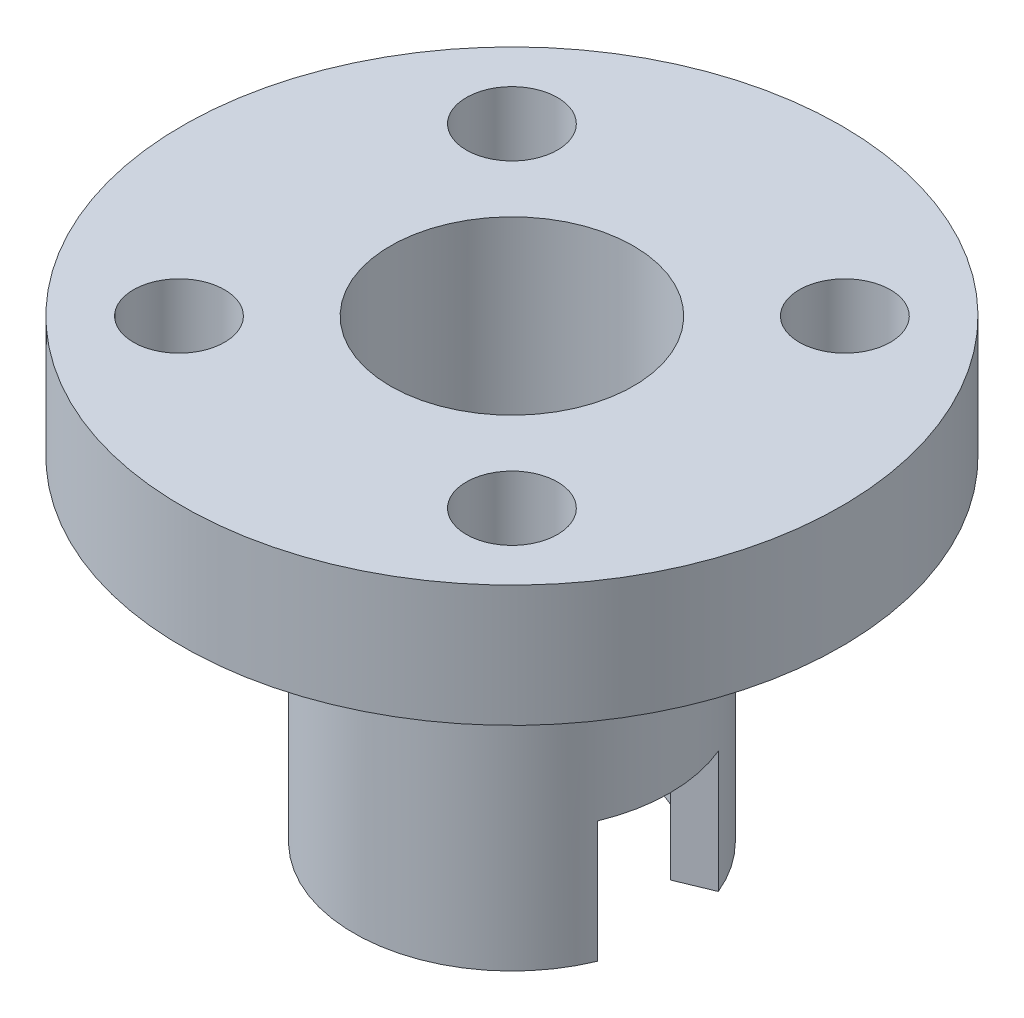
ISO-10303-21;
HEADER;
FILE_DESCRIPTION(('STEP AP214'),'2;1');
FILE_NAME('part.step','',(''),(''),'','','');
FILE_SCHEMA(('AUTOMOTIVE_DESIGN { 1 0 10303 214 1 1 1 1 }'));
ENDSEC;
DATA;
#1=APPLICATION_CONTEXT('core data for automotive mechanical design processes');
#2=APPLICATION_PROTOCOL_DEFINITION('international standard','automotive_design',2000,#1);
#3=PRODUCT_CONTEXT('',#1,'mechanical');
#4=PRODUCT('Part','Part','',(#3));
#5=PRODUCT_RELATED_PRODUCT_CATEGORY('part','',(#4));
#6=PRODUCT_DEFINITION_FORMATION('','',#4);
#7=PRODUCT_DEFINITION_CONTEXT('part definition',#1,'design');
#8=PRODUCT_DEFINITION('design','',#6,#7);
#9=PRODUCT_DEFINITION_SHAPE('','',#8);
#10=(LENGTH_UNIT() NAMED_UNIT(*) SI_UNIT(.MILLI.,.METRE.));
#11=(NAMED_UNIT(*) PLANE_ANGLE_UNIT() SI_UNIT($,.RADIAN.));
#12=(NAMED_UNIT(*) SI_UNIT($,.STERADIAN.) SOLID_ANGLE_UNIT());
#13=UNCERTAINTY_MEASURE_WITH_UNIT(LENGTH_MEASURE(1.E-05),#10,'distance_accuracy_value','');
#14=(GEOMETRIC_REPRESENTATION_CONTEXT(3) GLOBAL_UNCERTAINTY_ASSIGNED_CONTEXT((#13)) GLOBAL_UNIT_ASSIGNED_CONTEXT((#10,
#11,#12)) REPRESENTATION_CONTEXT('',''));
#15=CARTESIAN_POINT('',(0.,0.,0.));
#16=DIRECTION('',(0.,0.,1.));
#17=DIRECTION('',(1.,0.,0.));
#18=AXIS2_PLACEMENT_3D('',#15,#16,#17);
#19=CARTESIAN_POINT('',(0.,0.,0.));
#20=DIRECTION('',(0.,-1.,0.));
#21=DIRECTION('',(0.,0.,-1.));
#22=AXIS2_PLACEMENT_3D('',#19,#20,#21);
#23=CYLINDRICAL_SURFACE('',#22,5.2);
#24=CARTESIAN_POINT('',(0.,11.,0.));
#25=DIRECTION('',(0.,-1.,0.));
#26=DIRECTION('',(0.,0.,-1.));
#27=AXIS2_PLACEMENT_3D('',#24,#25,#26);
#28=CIRCLE('',#27,5.2);
#29=CARTESIAN_POINT('',(0.,11.,-5.2));
#30=VERTEX_POINT('',#29);
#31=EDGE_CURVE('E20',#30,#30,#28,.F.);
#32=ORIENTED_EDGE('',*,*,#31,.F.);
#33=EDGE_LOOP('',(#32));
#34=FACE_BOUND('',#33,.T.);
#35=DIRECTION('',(0.,1.,0.));
#36=VECTOR('',#35,1.);
#37=CARTESIAN_POINT('',(-4.80417356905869,4.,1.98995384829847));
#38=LINE('',#37,#36);
#39=CARTESIAN_POINT('',(-4.80417356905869,4.,1.98995384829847));
#40=VERTEX_POINT('',#39);
#41=CARTESIAN_POINT('',(-4.80417356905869,0.,1.98995384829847));
#42=VERTEX_POINT('',#41);
#43=EDGE_CURVE('E162',#40,#42,#38,.F.);
#44=ORIENTED_EDGE('',*,*,#43,.T.);
#45=CARTESIAN_POINT('',(0.,0.,0.));
#46=DIRECTION('',(0.,-1.,0.));
#47=DIRECTION('',(0.,0.,-1.));
#48=AXIS2_PLACEMENT_3D('',#45,#46,#47);
#49=CIRCLE('',#48,5.2);
#50=CARTESIAN_POINT('',(4.80417356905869,0.,1.98995384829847));
#51=VERTEX_POINT('',#50);
#52=EDGE_CURVE('E86',#51,#42,#49,.T.);
#53=ORIENTED_EDGE('',*,*,#52,.F.);
#54=DIRECTION('',(0.,1.,0.));
#55=VECTOR('',#54,1.);
#56=CARTESIAN_POINT('',(4.80417356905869,4.,1.98995384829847));
#57=LINE('',#56,#55);
#58=CARTESIAN_POINT('',(4.80417356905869,4.,1.98995384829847));
#59=VERTEX_POINT('',#58);
#60=EDGE_CURVE('E83',#59,#51,#57,.F.);
#61=ORIENTED_EDGE('',*,*,#60,.F.);
#62=CARTESIAN_POINT('',(0.,4.,0.));
#63=DIRECTION('',(0.,-1.,0.));
#64=DIRECTION('',(0.,0.,-1.));
#65=AXIS2_PLACEMENT_3D('',#62,#63,#64);
#66=CIRCLE('',#65,5.2);
#67=CARTESIAN_POINT('',(4.80417356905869,4.,-1.98995384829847));
#68=VERTEX_POINT('',#67);
#69=EDGE_CURVE('E80',#68,#59,#66,.T.);
#70=ORIENTED_EDGE('',*,*,#69,.F.);
#71=DIRECTION('',(0.,1.,0.));
#72=VECTOR('',#71,1.);
#73=CARTESIAN_POINT('',(4.80417356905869,4.,-1.98995384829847));
#74=LINE('',#73,#72);
#75=CARTESIAN_POINT('',(4.80417356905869,0.,-1.98995384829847));
#76=VERTEX_POINT('',#75);
#77=EDGE_CURVE('E103',#68,#76,#74,.F.);
#78=ORIENTED_EDGE('',*,*,#77,.T.);
#79=CARTESIAN_POINT('',(0.,0.,0.));
#80=DIRECTION('',(0.,-1.,0.));
#81=DIRECTION('',(0.,0.,-1.));
#82=AXIS2_PLACEMENT_3D('',#79,#80,#81);
#83=CIRCLE('',#82,5.2);
#84=CARTESIAN_POINT('',(-4.80417356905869,0.,-1.98995384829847));
#85=VERTEX_POINT('',#84);
#86=EDGE_CURVE('E106',#85,#76,#83,.T.);
#87=ORIENTED_EDGE('',*,*,#86,.F.);
#88=DIRECTION('',(0.,1.,0.));
#89=VECTOR('',#88,1.);
#90=CARTESIAN_POINT('',(-4.80417356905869,4.,-1.98995384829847));
#91=LINE('',#90,#89);
#92=CARTESIAN_POINT('',(-4.80417356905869,4.,-1.98995384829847));
#93=VERTEX_POINT('',#92);
#94=EDGE_CURVE('E159',#93,#85,#91,.F.);
#95=ORIENTED_EDGE('',*,*,#94,.F.);
#96=CARTESIAN_POINT('',(0.,4.,0.));
#97=DIRECTION('',(0.,-1.,0.));
#98=DIRECTION('',(0.,0.,-1.));
#99=AXIS2_PLACEMENT_3D('',#96,#97,#98);
#100=CIRCLE('',#99,5.2);
#101=EDGE_CURVE('E111',#40,#93,#100,.T.);
#102=ORIENTED_EDGE('',*,*,#101,.F.);
#103=EDGE_LOOP('',(#44,#53,#61,#70,#78,#87,#95,#102));
#104=FACE_BOUND('',#103,.T.);
#105=ADVANCED_FACE('F17',(#34,#104),#23,.T.);
#106=CARTESIAN_POINT('',(10.85,11.,0.));
#107=DIRECTION('',(0.,-1.,0.));
#108=DIRECTION('',(0.,0.,-1.));
#109=AXIS2_PLACEMENT_3D('',#106,#107,#108);
#110=PLANE('',#109);
#111=ORIENTED_EDGE('',*,*,#31,.T.);
#112=EDGE_LOOP('',(#111));
#113=FACE_BOUND('',#112,.T.);
#114=CARTESIAN_POINT('',(5.48007755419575,11.,-5.48007755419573));
#115=DIRECTION('',(0.,1.,0.));
#116=DIRECTION('',(0.,0.,1.));
#117=AXIS2_PLACEMENT_3D('',#114,#115,#116);
#118=CIRCLE('',#117,1.5);
#119=CARTESIAN_POINT('',(5.48007755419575,11.,-3.98007755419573));
#120=VERTEX_POINT('',#119);
#121=EDGE_CURVE('E131',#120,#120,#118,.T.);
#122=ORIENTED_EDGE('',*,*,#121,.T.);
#123=EDGE_LOOP('',(#122));
#124=FACE_BOUND('',#123,.T.);
#125=CARTESIAN_POINT('',(5.48007755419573,11.,5.48007755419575));
#126=DIRECTION('',(0.,1.,0.));
#127=DIRECTION('',(0.,0.,1.));
#128=AXIS2_PLACEMENT_3D('',#125,#126,#127);
#129=CIRCLE('',#128,1.5);
#130=CARTESIAN_POINT('',(5.48007755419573,11.,6.98007755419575));
#131=VERTEX_POINT('',#130);
#132=EDGE_CURVE('E128',#131,#131,#129,.T.);
#133=ORIENTED_EDGE('',*,*,#132,.T.);
#134=EDGE_LOOP('',(#133));
#135=FACE_BOUND('',#134,.T.);
#136=CARTESIAN_POINT('',(-5.48007755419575,11.,5.48007755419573));
#137=DIRECTION('',(0.,1.,0.));
#138=DIRECTION('',(0.,0.,1.));
#139=AXIS2_PLACEMENT_3D('',#136,#137,#138);
#140=CIRCLE('',#139,1.5);
#141=CARTESIAN_POINT('',(-5.48007755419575,11.,6.98007755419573));
#142=VERTEX_POINT('',#141);
#143=EDGE_CURVE('E125',#142,#142,#140,.T.);
#144=ORIENTED_EDGE('',*,*,#143,.T.);
#145=EDGE_LOOP('',(#144));
#146=FACE_BOUND('',#145,.T.);
#147=CARTESIAN_POINT('',(-5.48007755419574,11.,-5.48007755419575));
#148=DIRECTION('',(0.,1.,0.));
#149=DIRECTION('',(0.,0.,1.));
#150=AXIS2_PLACEMENT_3D('',#147,#148,#149);
#151=CIRCLE('',#150,1.5);
#152=CARTESIAN_POINT('',(-5.48007755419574,11.,-3.98007755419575));
#153=VERTEX_POINT('',#152);
#154=EDGE_CURVE('E122',#153,#153,#151,.T.);
#155=ORIENTED_EDGE('',*,*,#154,.T.);
#156=EDGE_LOOP('',(#155));
#157=FACE_BOUND('',#156,.T.);
#158=CARTESIAN_POINT('',(0.,11.,0.));
#159=DIRECTION('',(0.,-1.,0.));
#160=DIRECTION('',(0.,0.,-1.));
#161=AXIS2_PLACEMENT_3D('',#158,#159,#160);
#162=CIRCLE('',#161,10.85);
#163=CARTESIAN_POINT('',(0.,11.,-10.85));
#164=VERTEX_POINT('',#163);
#165=EDGE_CURVE('E119',#164,#164,#162,.F.);
#166=ORIENTED_EDGE('',*,*,#165,.F.);
#167=EDGE_LOOP('',(#166));
#168=FACE_BOUND('',#167,.T.);
#169=ADVANCED_FACE('F244',(#113,#124,#135,#146,#157,#168),#110,.T.);
#170=CARTESIAN_POINT('',(0.,4.,0.));
#171=DIRECTION('',(0.382683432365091,0.,-0.923879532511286));
#172=DIRECTION('',(-0.923879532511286,0.,-0.382683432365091));
#173=AXIS2_PLACEMENT_3D('',#170,#171,#172);
#174=PLANE('',#173);
#175=DIRECTION('',(-0.923879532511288,0.,-0.382683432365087));
#176=VECTOR('',#175,1.);
#177=CARTESIAN_POINT('',(4.80417356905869,4.,1.98995384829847));
#178=LINE('',#177,#176);
#179=CARTESIAN_POINT('',(3.69551813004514,4.,1.53073372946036));
#180=VERTEX_POINT('',#179);
#181=EDGE_CURVE('E90',#59,#180,#178,.T.);
#182=ORIENTED_EDGE('',*,*,#181,.F.);
#183=ORIENTED_EDGE('',*,*,#60,.T.);
#184=DIRECTION('',(0.923879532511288,0.,0.382683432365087));
#185=VECTOR('',#184,1.);
#186=CARTESIAN_POINT('',(3.69551813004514,0.,1.53073372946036));
#187=LINE('',#186,#185);
#188=CARTESIAN_POINT('',(3.69551813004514,0.,1.53073372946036));
#189=VERTEX_POINT('',#188);
#190=EDGE_CURVE('E118',#189,#51,#187,.T.);
#191=ORIENTED_EDGE('',*,*,#190,.F.);
#192=DIRECTION('',(0.,-1.,0.));
#193=VECTOR('',#192,1.);
#194=CARTESIAN_POINT('',(3.69551813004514,0.,1.53073372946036));
#195=LINE('',#194,#193);
#196=EDGE_CURVE('E95',#189,#180,#195,.F.);
#197=ORIENTED_EDGE('',*,*,#196,.T.);
#198=EDGE_LOOP('',(#182,#183,#191,#197));
#199=FACE_BOUND('',#198,.T.);
#200=ADVANCED_FACE('F93',(#199),#174,.T.);
#201=CARTESIAN_POINT('',(0.,4.,0.));
#202=DIRECTION('',(0.,-1.,0.));
#203=DIRECTION('',(0.,0.,-1.));
#204=AXIS2_PLACEMENT_3D('',#201,#202,#203);
#205=PLANE('',#204);
#206=DIRECTION('',(-0.923879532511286,0.,0.382683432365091));
#207=VECTOR('',#206,1.);
#208=CARTESIAN_POINT('',(0.,4.,0.));
#209=LINE('',#208,#207);
#210=CARTESIAN_POINT('',(3.69551813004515,4.,-1.53073372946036));
#211=VERTEX_POINT('',#210);
#212=EDGE_CURVE('E101',#211,#68,#209,.F.);
#213=ORIENTED_EDGE('',*,*,#212,.T.);
#214=ORIENTED_EDGE('',*,*,#69,.T.);
#215=ORIENTED_EDGE('',*,*,#181,.T.);
#216=CARTESIAN_POINT('',(0.,4.,0.));
#217=DIRECTION('',(0.,-1.,0.));
#218=DIRECTION('',(0.,0.,-1.));
#219=AXIS2_PLACEMENT_3D('',#216,#217,#218);
#220=CIRCLE('',#219,4.);
#221=EDGE_CURVE('E134',#180,#211,#220,.F.);
#222=ORIENTED_EDGE('',*,*,#221,.T.);
#223=EDGE_LOOP('',(#213,#214,#215,#222));
#224=FACE_BOUND('',#223,.T.);
#225=ADVANCED_FACE('F99',(#224),#205,.T.);
#226=CARTESIAN_POINT('',(0.,4.,0.));
#227=DIRECTION('',(-0.382683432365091,0.,-0.923879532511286));
#228=DIRECTION('',(-0.923879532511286,0.,0.382683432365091));
#229=AXIS2_PLACEMENT_3D('',#226,#227,#228);
#230=PLANE('',#229);
#231=ORIENTED_EDGE('',*,*,#77,.F.);
#232=ORIENTED_EDGE('',*,*,#212,.F.);
#233=DIRECTION('',(0.,-1.,0.));
#234=VECTOR('',#233,1.);
#235=CARTESIAN_POINT('',(3.69551813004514,0.,-1.53073372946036));
#236=LINE('',#235,#234);
#237=CARTESIAN_POINT('',(3.69551813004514,0.,-1.53073372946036));
#238=VERTEX_POINT('',#237);
#239=EDGE_CURVE('E136',#211,#238,#236,.T.);
#240=ORIENTED_EDGE('',*,*,#239,.T.);
#241=DIRECTION('',(-0.923879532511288,0.,0.382683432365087));
#242=VECTOR('',#241,1.);
#243=CARTESIAN_POINT('',(4.80417356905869,0.,-1.98995384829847));
#244=LINE('',#243,#242);
#245=EDGE_CURVE('E110',#76,#238,#244,.T.);
#246=ORIENTED_EDGE('',*,*,#245,.F.);
#247=EDGE_LOOP('',(#231,#232,#240,#246));
#248=FACE_BOUND('',#247,.T.);
#249=ADVANCED_FACE('F188',(#248),#230,.F.);
#250=CARTESIAN_POINT('',(5.2,0.,0.));
#251=DIRECTION('',(0.,-1.,0.));
#252=DIRECTION('',(0.,0.,-1.));
#253=AXIS2_PLACEMENT_3D('',#250,#251,#252);
#254=PLANE('',#253);
#255=DIRECTION('',(0.923879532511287,0.,0.38268343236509));
#256=VECTOR('',#255,1.);
#257=CARTESIAN_POINT('',(0.,0.,0.));
#258=LINE('',#257,#256);
#259=CARTESIAN_POINT('',(-3.69551813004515,0.,-1.53073372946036));
#260=VERTEX_POINT('',#259);
#261=EDGE_CURVE('E109',#85,#260,#258,.T.);
#262=ORIENTED_EDGE('',*,*,#261,.F.);
#263=ORIENTED_EDGE('',*,*,#86,.T.);
#264=ORIENTED_EDGE('',*,*,#245,.T.);
#265=CARTESIAN_POINT('',(0.,0.,0.));
#266=DIRECTION('',(0.,-1.,0.));
#267=DIRECTION('',(0.,0.,-1.));
#268=AXIS2_PLACEMENT_3D('',#265,#266,#267);
#269=CIRCLE('',#268,4.);
#270=EDGE_CURVE('E137',#238,#260,#269,.F.);
#271=ORIENTED_EDGE('',*,*,#270,.T.);
#272=EDGE_LOOP('',(#262,#263,#264,#271));
#273=FACE_BOUND('',#272,.T.);
#274=ADVANCED_FACE('F193',(#273),#254,.T.);
#275=CARTESIAN_POINT('',(0.,4.,0.));
#276=DIRECTION('',(-0.38268343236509,0.,0.923879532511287));
#277=DIRECTION('',(0.923879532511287,0.,0.38268343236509));
#278=AXIS2_PLACEMENT_3D('',#275,#276,#277);
#279=PLANE('',#278);
#280=DIRECTION('',(0.923879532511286,0.,0.382683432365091));
#281=VECTOR('',#280,1.);
#282=CARTESIAN_POINT('',(-4.80417356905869,4.,-1.98995384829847));
#283=LINE('',#282,#281);
#284=CARTESIAN_POINT('',(-3.69551813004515,4.,-1.53073372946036));
#285=VERTEX_POINT('',#284);
#286=EDGE_CURVE('E115',#93,#285,#283,.T.);
#287=ORIENTED_EDGE('',*,*,#286,.F.);
#288=ORIENTED_EDGE('',*,*,#94,.T.);
#289=ORIENTED_EDGE('',*,*,#261,.T.);
#290=DIRECTION('',(0.,-1.,0.));
#291=VECTOR('',#290,1.);
#292=CARTESIAN_POINT('',(-3.69551813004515,0.,-1.53073372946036));
#293=LINE('',#292,#291);
#294=EDGE_CURVE('E139',#260,#285,#293,.F.);
#295=ORIENTED_EDGE('',*,*,#294,.T.);
#296=EDGE_LOOP('',(#287,#288,#289,#295));
#297=FACE_BOUND('',#296,.T.);
#298=ADVANCED_FACE('F196',(#297),#279,.T.);
#299=CARTESIAN_POINT('',(0.,4.,0.));
#300=DIRECTION('',(0.,-1.,0.));
#301=DIRECTION('',(0.,0.,-1.));
#302=AXIS2_PLACEMENT_3D('',#299,#300,#301);
#303=PLANE('',#302);
#304=DIRECTION('',(0.923879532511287,0.,-0.38268343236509));
#305=VECTOR('',#304,1.);
#306=CARTESIAN_POINT('',(0.,4.,0.));
#307=LINE('',#306,#305);
#308=CARTESIAN_POINT('',(-3.69551813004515,4.,1.53073372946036));
#309=VERTEX_POINT('',#308);
#310=EDGE_CURVE('E114',#309,#40,#307,.F.);
#311=ORIENTED_EDGE('',*,*,#310,.T.);
#312=ORIENTED_EDGE('',*,*,#101,.T.);
#313=ORIENTED_EDGE('',*,*,#286,.T.);
#314=CARTESIAN_POINT('',(0.,4.,0.));
#315=DIRECTION('',(0.,-1.,0.));
#316=DIRECTION('',(0.,0.,-1.));
#317=AXIS2_PLACEMENT_3D('',#314,#315,#316);
#318=CIRCLE('',#317,4.);
#319=EDGE_CURVE('E140',#285,#309,#318,.F.);
#320=ORIENTED_EDGE('',*,*,#319,.T.);
#321=EDGE_LOOP('',(#311,#312,#313,#320));
#322=FACE_BOUND('',#321,.T.);
#323=ADVANCED_FACE('F198',(#322),#303,.T.);
#324=CARTESIAN_POINT('',(0.,4.,0.));
#325=DIRECTION('',(0.38268343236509,0.,0.923879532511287));
#326=DIRECTION('',(0.923879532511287,0.,-0.38268343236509));
#327=AXIS2_PLACEMENT_3D('',#324,#325,#326);
#328=PLANE('',#327);
#329=ORIENTED_EDGE('',*,*,#43,.F.);
#330=ORIENTED_EDGE('',*,*,#310,.F.);
#331=DIRECTION('',(0.,-1.,0.));
#332=VECTOR('',#331,1.);
#333=CARTESIAN_POINT('',(-3.69551813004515,0.,1.53073372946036));
#334=LINE('',#333,#332);
#335=CARTESIAN_POINT('',(-3.69551813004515,0.,1.53073372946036));
#336=VERTEX_POINT('',#335);
#337=EDGE_CURVE('E35',#309,#336,#334,.T.);
#338=ORIENTED_EDGE('',*,*,#337,.T.);
#339=DIRECTION('',(0.923879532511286,0.,-0.382683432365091));
#340=VECTOR('',#339,1.);
#341=CARTESIAN_POINT('',(-4.80417356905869,0.,1.98995384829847));
#342=LINE('',#341,#340);
#343=EDGE_CURVE('E117',#42,#336,#342,.T.);
#344=ORIENTED_EDGE('',*,*,#343,.F.);
#345=EDGE_LOOP('',(#329,#330,#338,#344));
#346=FACE_BOUND('',#345,.T.);
#347=ADVANCED_FACE('F199',(#346),#328,.F.);
#348=CARTESIAN_POINT('',(5.2,0.,0.));
#349=DIRECTION('',(0.,-1.,0.));
#350=DIRECTION('',(0.,0.,-1.));
#351=AXIS2_PLACEMENT_3D('',#348,#349,#350);
#352=PLANE('',#351);
#353=ORIENTED_EDGE('',*,*,#343,.T.);
#354=CARTESIAN_POINT('',(0.,0.,0.));
#355=DIRECTION('',(0.,-1.,0.));
#356=DIRECTION('',(0.,0.,-1.));
#357=AXIS2_PLACEMENT_3D('',#354,#355,#356);
#358=CIRCLE('',#357,4.);
#359=EDGE_CURVE('E142',#336,#189,#358,.F.);
#360=ORIENTED_EDGE('',*,*,#359,.T.);
#361=ORIENTED_EDGE('',*,*,#190,.T.);
#362=ORIENTED_EDGE('',*,*,#52,.T.);
#363=EDGE_LOOP('',(#353,#360,#361,#362));
#364=FACE_BOUND('',#363,.T.);
#365=ADVANCED_FACE('F180',(#364),#352,.T.);
#366=CARTESIAN_POINT('',(0.,0.,0.));
#367=DIRECTION('',(0.,-1.,0.));
#368=DIRECTION('',(0.,0.,-1.));
#369=AXIS2_PLACEMENT_3D('',#366,#367,#368);
#370=CYLINDRICAL_SURFACE('',#369,10.85);
#371=CARTESIAN_POINT('',(0.,15.,0.));
#372=DIRECTION('',(0.,-1.,0.));
#373=DIRECTION('',(0.,0.,-1.));
#374=AXIS2_PLACEMENT_3D('',#371,#372,#373);
#375=CIRCLE('',#374,10.85);
#376=CARTESIAN_POINT('',(0.,15.,-10.85));
#377=VERTEX_POINT('',#376);
#378=EDGE_CURVE('E144',#377,#377,#375,.F.);
#379=ORIENTED_EDGE('',*,*,#378,.F.);
#380=EDGE_LOOP('',(#379));
#381=FACE_BOUND('',#380,.T.);
#382=ORIENTED_EDGE('',*,*,#165,.T.);
#383=EDGE_LOOP('',(#382));
#384=FACE_BOUND('',#383,.T.);
#385=ADVANCED_FACE('F207',(#381,#384),#370,.T.);
#386=CARTESIAN_POINT('',(-5.48007755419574,0.,-5.48007755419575));
#387=DIRECTION('',(0.,1.,0.));
#388=DIRECTION('',(0.,0.,1.));
#389=AXIS2_PLACEMENT_3D('',#386,#387,#388);
#390=CYLINDRICAL_SURFACE('',#389,1.5);
#391=CARTESIAN_POINT('',(-5.48007755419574,15.,-5.48007755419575));
#392=DIRECTION('',(0.,1.,0.));
#393=DIRECTION('',(0.,0.,1.));
#394=AXIS2_PLACEMENT_3D('',#391,#392,#393);
#395=CIRCLE('',#394,1.5);
#396=CARTESIAN_POINT('',(-5.48007755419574,15.,-3.98007755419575));
#397=VERTEX_POINT('',#396);
#398=EDGE_CURVE('E147',#397,#397,#395,.F.);
#399=ORIENTED_EDGE('',*,*,#398,.F.);
#400=EDGE_LOOP('',(#399));
#401=FACE_BOUND('',#400,.T.);
#402=ORIENTED_EDGE('',*,*,#154,.F.);
#403=EDGE_LOOP('',(#402));
#404=FACE_BOUND('',#403,.T.);
#405=ADVANCED_FACE('F231',(#401,#404),#390,.F.);
#406=CARTESIAN_POINT('',(-5.48007755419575,0.,5.48007755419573));
#407=DIRECTION('',(0.,1.,0.));
#408=DIRECTION('',(0.,0.,1.));
#409=AXIS2_PLACEMENT_3D('',#406,#407,#408);
#410=CYLINDRICAL_SURFACE('',#409,1.5);
#411=CARTESIAN_POINT('',(-5.48007755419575,15.,5.48007755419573));
#412=DIRECTION('',(0.,1.,0.));
#413=DIRECTION('',(0.,0.,1.));
#414=AXIS2_PLACEMENT_3D('',#411,#412,#413);
#415=CIRCLE('',#414,1.5);
#416=CARTESIAN_POINT('',(-5.48007755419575,15.,6.98007755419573));
#417=VERTEX_POINT('',#416);
#418=EDGE_CURVE('E150',#417,#417,#415,.F.);
#419=ORIENTED_EDGE('',*,*,#418,.F.);
#420=EDGE_LOOP('',(#419));
#421=FACE_BOUND('',#420,.T.);
#422=ORIENTED_EDGE('',*,*,#143,.F.);
#423=EDGE_LOOP('',(#422));
#424=FACE_BOUND('',#423,.T.);
#425=ADVANCED_FACE('F227',(#421,#424),#410,.F.);
#426=CARTESIAN_POINT('',(5.48007755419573,0.,5.48007755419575));
#427=DIRECTION('',(0.,1.,0.));
#428=DIRECTION('',(0.,0.,1.));
#429=AXIS2_PLACEMENT_3D('',#426,#427,#428);
#430=CYLINDRICAL_SURFACE('',#429,1.5);
#431=CARTESIAN_POINT('',(5.48007755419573,15.,5.48007755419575));
#432=DIRECTION('',(0.,1.,0.));
#433=DIRECTION('',(0.,0.,1.));
#434=AXIS2_PLACEMENT_3D('',#431,#432,#433);
#435=CIRCLE('',#434,1.5);
#436=CARTESIAN_POINT('',(5.48007755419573,15.,6.98007755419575));
#437=VERTEX_POINT('',#436);
#438=EDGE_CURVE('E153',#437,#437,#435,.F.);
#439=ORIENTED_EDGE('',*,*,#438,.F.);
#440=EDGE_LOOP('',(#439));
#441=FACE_BOUND('',#440,.T.);
#442=ORIENTED_EDGE('',*,*,#132,.F.);
#443=EDGE_LOOP('',(#442));
#444=FACE_BOUND('',#443,.T.);
#445=ADVANCED_FACE('F223',(#441,#444),#430,.F.);
#446=CARTESIAN_POINT('',(5.48007755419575,0.,-5.48007755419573));
#447=DIRECTION('',(0.,1.,0.));
#448=DIRECTION('',(0.,0.,1.));
#449=AXIS2_PLACEMENT_3D('',#446,#447,#448);
#450=CYLINDRICAL_SURFACE('',#449,1.5);
#451=CARTESIAN_POINT('',(5.48007755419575,15.,-5.48007755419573));
#452=DIRECTION('',(0.,1.,0.));
#453=DIRECTION('',(0.,0.,1.));
#454=AXIS2_PLACEMENT_3D('',#451,#452,#453);
#455=CIRCLE('',#454,1.5);
#456=CARTESIAN_POINT('',(5.48007755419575,15.,-3.98007755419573));
#457=VERTEX_POINT('',#456);
#458=EDGE_CURVE('E26',#457,#457,#455,.F.);
#459=ORIENTED_EDGE('',*,*,#458,.F.);
#460=EDGE_LOOP('',(#459));
#461=FACE_BOUND('',#460,.T.);
#462=ORIENTED_EDGE('',*,*,#121,.F.);
#463=EDGE_LOOP('',(#462));
#464=FACE_BOUND('',#463,.T.);
#465=ADVANCED_FACE('F217',(#461,#464),#450,.F.);
#466=CARTESIAN_POINT('',(0.,0.,0.));
#467=DIRECTION('',(0.,-1.,0.));
#468=DIRECTION('',(0.,0.,-1.));
#469=AXIS2_PLACEMENT_3D('',#466,#467,#468);
#470=CYLINDRICAL_SURFACE('',#469,4.);
#471=ORIENTED_EDGE('',*,*,#270,.F.);
#472=ORIENTED_EDGE('',*,*,#239,.F.);
#473=ORIENTED_EDGE('',*,*,#221,.F.);
#474=ORIENTED_EDGE('',*,*,#196,.F.);
#475=ORIENTED_EDGE('',*,*,#359,.F.);
#476=ORIENTED_EDGE('',*,*,#337,.F.);
#477=ORIENTED_EDGE('',*,*,#319,.F.);
#478=ORIENTED_EDGE('',*,*,#294,.F.);
#479=EDGE_LOOP('',(#471,#472,#473,#474,#475,#476,#477,#478));
#480=FACE_BOUND('',#479,.T.);
#481=CARTESIAN_POINT('',(0.,15.,0.));
#482=DIRECTION('',(0.,-1.,0.));
#483=DIRECTION('',(0.,0.,-1.));
#484=AXIS2_PLACEMENT_3D('',#481,#482,#483);
#485=CIRCLE('',#484,4.);
#486=CARTESIAN_POINT('',(0.,15.,-4.));
#487=VERTEX_POINT('',#486);
#488=EDGE_CURVE('E11',#487,#487,#485,.T.);
#489=ORIENTED_EDGE('',*,*,#488,.F.);
#490=EDGE_LOOP('',(#489));
#491=FACE_BOUND('',#490,.T.);
#492=ADVANCED_FACE('F183',(#480,#491),#470,.F.);
#493=CARTESIAN_POINT('',(4.,15.,0.));
#494=DIRECTION('',(0.,1.,0.));
#495=DIRECTION('',(0.,0.,1.));
#496=AXIS2_PLACEMENT_3D('',#493,#494,#495);
#497=PLANE('',#496);
#498=ORIENTED_EDGE('',*,*,#488,.T.);
#499=EDGE_LOOP('',(#498));
#500=FACE_BOUND('',#499,.T.);
#501=ORIENTED_EDGE('',*,*,#458,.T.);
#502=EDGE_LOOP('',(#501));
#503=FACE_BOUND('',#502,.T.);
#504=ORIENTED_EDGE('',*,*,#438,.T.);
#505=EDGE_LOOP('',(#504));
#506=FACE_BOUND('',#505,.T.);
#507=ORIENTED_EDGE('',*,*,#418,.T.);
#508=EDGE_LOOP('',(#507));
#509=FACE_BOUND('',#508,.T.);
#510=ORIENTED_EDGE('',*,*,#398,.T.);
#511=EDGE_LOOP('',(#510));
#512=FACE_BOUND('',#511,.T.);
#513=ORIENTED_EDGE('',*,*,#378,.T.);
#514=EDGE_LOOP('',(#513));
#515=FACE_BOUND('',#514,.T.);
#516=ADVANCED_FACE('F210',(#500,#503,#506,#509,#512,#515),#497,.T.);
#517=CLOSED_SHELL('',(#105,#169,#200,#225,#249,#274,#298,#323,#347,#365,#385,#405,#425,#445,
#465,#492,#516));
#518=MANIFOLD_SOLID_BREP('B1',#517);
#519=ADVANCED_BREP_SHAPE_REPRESENTATION('',(#18,#518),#14);
#520=SHAPE_DEFINITION_REPRESENTATION(#9,#519);
ENDSEC;
END-ISO-10303-21;
